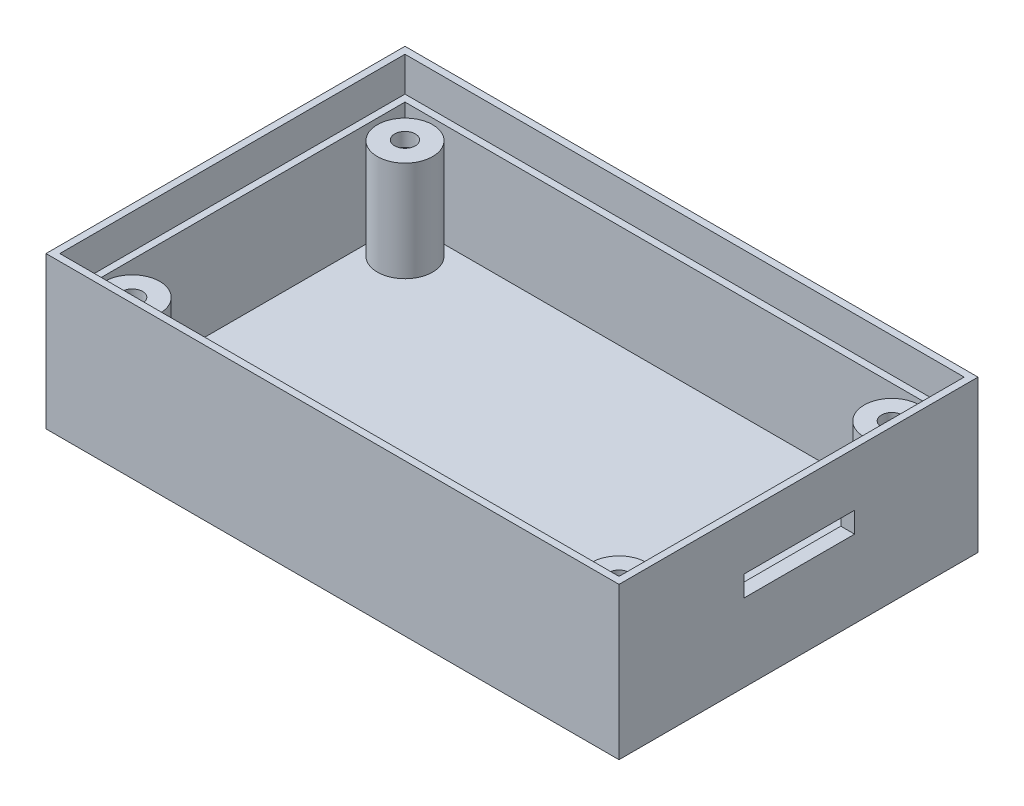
from build123d import *

# Parameters (mm, degrees)
SKETCH2_W            = 83
SKETCH2_H            = 52
BOSS_EXTRUDE1_DEPTH  = 2
SKETCH4_W            = 83
SKETCH4_H            = 52
SKETCH4_W_2          = 79
SKETCH4_H_2          = 48
BOSS_EXTRUDE5_DEPTH  = 20
SKETCH5_W            = 81
SKETCH5_H            = 50
CUT_EXTRUDE1_DEPTH   = 5
SKETCH10_R           = 4
BOSS_EXTRUDE31_DEPTH = 14.5
SKETCH11_R           = 4
BOSS_EXTRUDE32_DEPTH = 14.5
SKETCH12_R           = 1.5
CUT_EXTRUDE3_DEPTH   = 20
SKETCH13_R           = 2.5
CUT_EXTRUDE4_DEPTH   = 14.5
SKETCH14_W           = 16
SKETCH14_H           = 3.003763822
CUT_EXTRUDE5_DEPTH   = 2


with BuildPart() as part:
    # Sketch2 → Boss-Extrude1 (new body)
    with BuildSketch(Plane(origin=(0, 0, 0), x_dir=(1, 0, 0), z_dir=(0, 1, 0))):
        with Locations((25.558581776, 0.23866815)):
            Rectangle(SKETCH2_W, SKETCH2_H)
    extrude(amount=BOSS_EXTRUDE1_DEPTH)

    # Sketch4 → Boss-Extrude5 (add)
    with BuildSketch(Plane(origin=(0, 2, 0), x_dir=(1, 0, 0), z_dir=(0, 1, 0))):
        with Locations((25.558581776, 0.23866815)):
            Rectangle(SKETCH4_W, SKETCH4_H)
        with Locations((25.558581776, 0.23866815)):
            Rectangle(SKETCH4_W_2, SKETCH4_H_2, mode=Mode.SUBTRACT)
    extrude(amount=BOSS_EXTRUDE5_DEPTH)

    # Sketch5 → Cut-Extrude1 (cut)
    with BuildSketch(Plane(origin=(0, 22, 0), x_dir=(1, 0, 0), z_dir=(0, 1, 0))):
        with Locations((25.558581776, 0.23866815)):
            Rectangle(SKETCH5_W, SKETCH5_H)
    extrude(amount=-CUT_EXTRUDE1_DEPTH, mode=Mode.SUBTRACT)

    # Sketch10 → Boss-Extrude31 (add)
    with BuildSketch(Plane(origin=(0, 2, 0), x_dir=(1, 0, 0), z_dir=(0, 1, 0))):
        with Locations(Location((-9.604667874, 19.901917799, 0), (0, 0, 90))):
            Circle(SKETCH10_R)
    extrude(amount=BOSS_EXTRUDE31_DEPTH)

    # Sketch11 → Boss-Extrude32 (add)
    with BuildSketch(Plane(origin=(0, 2, 0), x_dir=(1, 0, 0), z_dir=(0, 1, 0))):
        with Locations(Location((-9.698777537, -19.518691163, 0), (0, 0, 90))):
            Circle(SKETCH11_R)
        with Locations(Location((60.815941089, -19.518691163, 0), (0, 0, 90))):
            Circle(SKETCH11_R)
        with Locations(Location((60.815941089, 19.996027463, 0), (0, 0, 90))):
            Circle(SKETCH11_R)
    extrude(amount=BOSS_EXTRUDE32_DEPTH)

    # Sketch12 → Cut-Extrude3 (cut)
    with BuildSketch(Plane(origin=(0, 16.5, 0), x_dir=(1, 0, 0), z_dir=(0, 1, 0))):
        with Locations(Location((-9.698777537, 19.996027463, 0), (0, 0, 270))):
            Circle(SKETCH12_R)
        with Locations(Location((-9.698777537, -19.518691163, 0), (0, 0, 270))):
            Circle(SKETCH12_R)
        with Locations(Location((60.815941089, -19.518691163, 0), (0, 0, 270))):
            Circle(SKETCH12_R)
        with Locations(Location((60.815941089, 19.996027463, 0), (0, 0, 270))):
            Circle(SKETCH12_R)
    extrude(amount=-CUT_EXTRUDE3_DEPTH, mode=Mode.SUBTRACT)

    # Sketch13 → Cut-Extrude4 (cut)
    with BuildSketch(Plane.XZ):
        with Locations(Location((-9.698777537, 19.518691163, 0), (0, 0, 270))):
            Circle(SKETCH13_R)
        with Locations(Location((60.815941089, 19.518691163, 0), (0, 0, 270))):
            Circle(SKETCH13_R)
        with Locations(Location((60.815941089, -19.996027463, 0), (0, 0, 270))):
            Circle(SKETCH13_R)
        with Locations(Location((-9.698777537, -19.996027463, 0), (0, 0, 270))):
            Circle(SKETCH13_R)
    extrude(amount=-CUT_EXTRUDE4_DEPTH, mode=Mode.SUBTRACT)

    # Sketch14 → Cut-Extrude5 (cut)
    with BuildSketch(Plane(origin=(67.058581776, 0, 0), x_dir=(0, 0, -1), z_dir=(1, 0, 0))):
        with Locations((0.363213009, 12.73747123)):
            Rectangle(SKETCH14_W, SKETCH14_H)
    extrude(amount=-CUT_EXTRUDE5_DEPTH, mode=Mode.SUBTRACT)


solid = part.part
